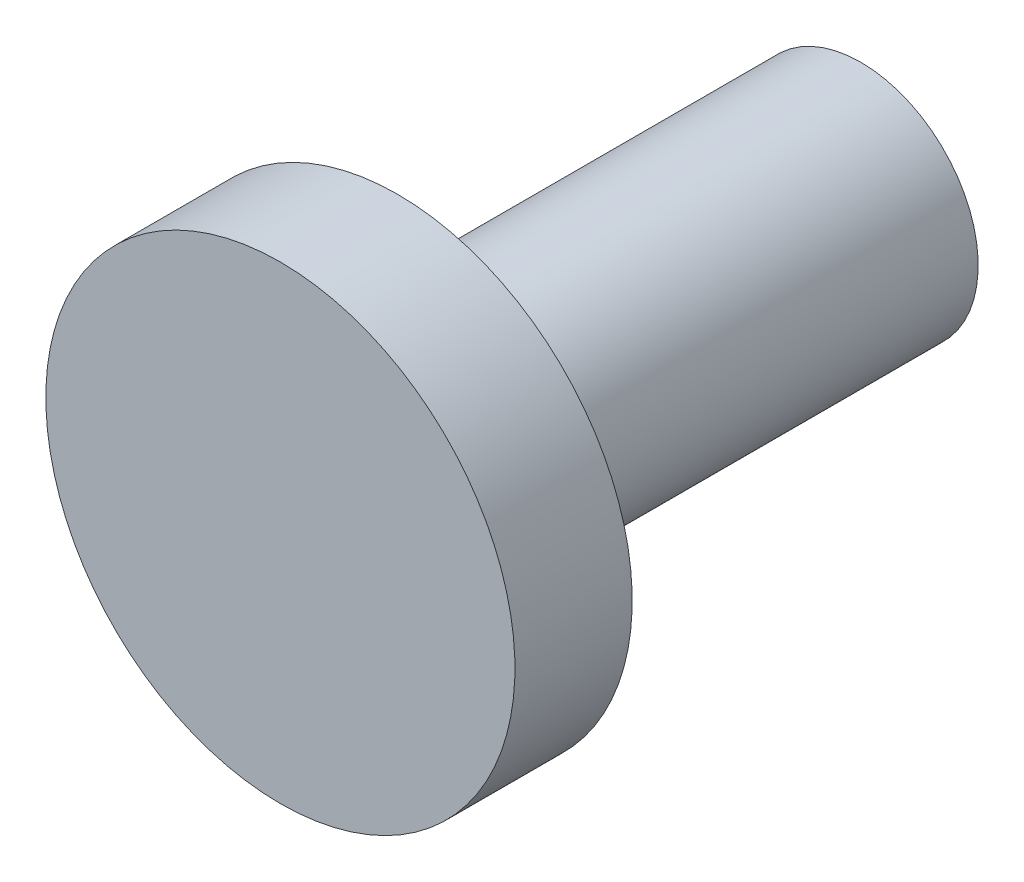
ISO-10303-21;
HEADER;
FILE_DESCRIPTION(('STEP AP214'),'2;1');
FILE_NAME('part.step','',(''),(''),'','','');
FILE_SCHEMA(('AUTOMOTIVE_DESIGN { 1 0 10303 214 1 1 1 1 }'));
ENDSEC;
DATA;
#1=APPLICATION_CONTEXT('core data for automotive mechanical design processes');
#2=APPLICATION_PROTOCOL_DEFINITION('international standard','automotive_design',2000,#1);
#3=PRODUCT_CONTEXT('',#1,'mechanical');
#4=PRODUCT('Part','Part','',(#3));
#5=PRODUCT_RELATED_PRODUCT_CATEGORY('part','',(#4));
#6=PRODUCT_DEFINITION_FORMATION('','',#4);
#7=PRODUCT_DEFINITION_CONTEXT('part definition',#1,'design');
#8=PRODUCT_DEFINITION('design','',#6,#7);
#9=PRODUCT_DEFINITION_SHAPE('','',#8);
#10=(LENGTH_UNIT() NAMED_UNIT(*) SI_UNIT(.MILLI.,.METRE.));
#11=(NAMED_UNIT(*) PLANE_ANGLE_UNIT() SI_UNIT($,.RADIAN.));
#12=(NAMED_UNIT(*) SI_UNIT($,.STERADIAN.) SOLID_ANGLE_UNIT());
#13=UNCERTAINTY_MEASURE_WITH_UNIT(LENGTH_MEASURE(1.E-05),#10,'distance_accuracy_value','');
#14=(GEOMETRIC_REPRESENTATION_CONTEXT(3) GLOBAL_UNCERTAINTY_ASSIGNED_CONTEXT((#13)) GLOBAL_UNIT_ASSIGNED_CONTEXT((#10,
#11,#12)) REPRESENTATION_CONTEXT('',''));
#15=CARTESIAN_POINT('',(0.,0.,0.));
#16=DIRECTION('',(0.,0.,1.));
#17=DIRECTION('',(1.,0.,0.));
#18=AXIS2_PLACEMENT_3D('',#15,#16,#17);
#19=CARTESIAN_POINT('',(0.,0.,-39.5));
#20=DIRECTION('',(0.,0.,-1.));
#21=DIRECTION('',(0.,1.,0.));
#22=AXIS2_PLACEMENT_3D('',#19,#20,#21);
#23=PLANE('',#22);
#24=CARTESIAN_POINT('',(0.,0.,-39.5));
#25=DIRECTION('',(0.,0.,-1.));
#26=DIRECTION('',(0.,1.,0.));
#27=AXIS2_PLACEMENT_3D('',#24,#25,#26);
#28=CIRCLE('',#27,10.);
#29=CARTESIAN_POINT('',(0.,10.,-39.5));
#30=VERTEX_POINT('',#29);
#31=EDGE_CURVE('E8',#30,#30,#28,.T.);
#32=ORIENTED_EDGE('',*,*,#31,.T.);
#33=EDGE_LOOP('',(#32));
#34=FACE_BOUND('',#33,.T.);
#35=ADVANCED_FACE('F12',(#34),#23,.T.);
#36=CARTESIAN_POINT('',(0.,0.,-49.5));
#37=DIRECTION('',(0.,0.,-1.));
#38=DIRECTION('',(0.,1.,0.));
#39=AXIS2_PLACEMENT_3D('',#36,#37,#38);
#40=CYLINDRICAL_SURFACE('',#39,10.);
#41=CARTESIAN_POINT('',(0.,0.,0.));
#42=DIRECTION('',(0.,0.,-1.));
#43=DIRECTION('',(0.,1.,0.));
#44=AXIS2_PLACEMENT_3D('',#41,#42,#43);
#45=CIRCLE('',#44,10.);
#46=CARTESIAN_POINT('',(0.,10.,0.));
#47=VERTEX_POINT('',#46);
#48=EDGE_CURVE('E18',#47,#47,#45,.T.);
#49=ORIENTED_EDGE('',*,*,#48,.T.);
#50=EDGE_LOOP('',(#49));
#51=FACE_BOUND('',#50,.T.);
#52=ORIENTED_EDGE('',*,*,#31,.F.);
#53=EDGE_LOOP('',(#52));
#54=FACE_BOUND('',#53,.T.);
#55=ADVANCED_FACE('F45',(#51,#54),#40,.T.);
#56=CARTESIAN_POINT('',(10.,0.,0.));
#57=DIRECTION('',(0.,0.,-1.));
#58=DIRECTION('',(0.,1.,0.));
#59=AXIS2_PLACEMENT_3D('',#56,#57,#58);
#60=PLANE('',#59);
#61=CARTESIAN_POINT('',(0.,0.,0.));
#62=DIRECTION('',(0.,0.,-1.));
#63=DIRECTION('',(0.,1.,0.));
#64=AXIS2_PLACEMENT_3D('',#61,#62,#63);
#65=CIRCLE('',#64,20.);
#66=CARTESIAN_POINT('',(0.,20.,0.));
#67=VERTEX_POINT('',#66);
#68=EDGE_CURVE('E22',#67,#67,#65,.T.);
#69=ORIENTED_EDGE('',*,*,#68,.T.);
#70=EDGE_LOOP('',(#69));
#71=FACE_BOUND('',#70,.T.);
#72=ORIENTED_EDGE('',*,*,#48,.F.);
#73=EDGE_LOOP('',(#72));
#74=FACE_BOUND('',#73,.T.);
#75=ADVANCED_FACE('F42',(#71,#74),#60,.T.);
#76=CARTESIAN_POINT('',(0.,0.,-49.5));
#77=DIRECTION('',(0.,0.,-1.));
#78=DIRECTION('',(0.,1.,0.));
#79=AXIS2_PLACEMENT_3D('',#76,#77,#78);
#80=CYLINDRICAL_SURFACE('',#79,20.);
#81=CARTESIAN_POINT('',(0.,0.,10.));
#82=DIRECTION('',(0.,0.,-1.));
#83=DIRECTION('',(0.,1.,0.));
#84=AXIS2_PLACEMENT_3D('',#81,#82,#83);
#85=CIRCLE('',#84,20.);
#86=CARTESIAN_POINT('',(0.,20.,10.));
#87=VERTEX_POINT('',#86);
#88=EDGE_CURVE('E26',#87,#87,#85,.T.);
#89=ORIENTED_EDGE('',*,*,#88,.T.);
#90=EDGE_LOOP('',(#89));
#91=FACE_BOUND('',#90,.T.);
#92=ORIENTED_EDGE('',*,*,#68,.F.);
#93=EDGE_LOOP('',(#92));
#94=FACE_BOUND('',#93,.T.);
#95=ADVANCED_FACE('F32',(#91,#94),#80,.T.);
#96=CARTESIAN_POINT('',(20.,0.,10.));
#97=DIRECTION('',(0.,0.,1.));
#98=DIRECTION('',(0.,-1.,0.));
#99=AXIS2_PLACEMENT_3D('',#96,#97,#98);
#100=PLANE('',#99);
#101=ORIENTED_EDGE('',*,*,#88,.F.);
#102=EDGE_LOOP('',(#101));
#103=FACE_BOUND('',#102,.T.);
#104=ADVANCED_FACE('F35',(#103),#100,.T.);
#105=CLOSED_SHELL('',(#35,#55,#75,#95,#104));
#106=MANIFOLD_SOLID_BREP('B1',#105);
#107=ADVANCED_BREP_SHAPE_REPRESENTATION('',(#18,#106),#14);
#108=SHAPE_DEFINITION_REPRESENTATION(#9,#107);
ENDSEC;
END-ISO-10303-21;
